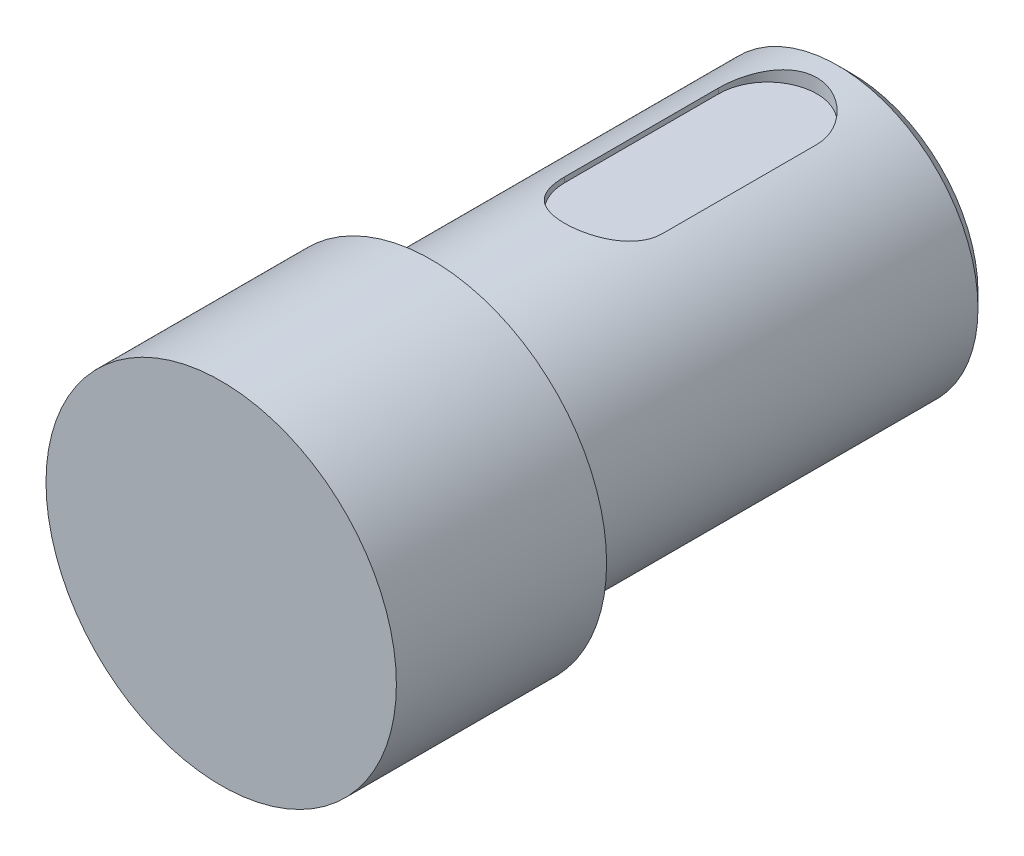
ISO-10303-21;
HEADER;
FILE_DESCRIPTION(('STEP AP214'),'2;1');
FILE_NAME('part.step','',(''),(''),'','','');
FILE_SCHEMA(('AUTOMOTIVE_DESIGN { 1 0 10303 214 1 1 1 1 }'));
ENDSEC;
DATA;
#1=APPLICATION_CONTEXT('core data for automotive mechanical design processes');
#2=APPLICATION_PROTOCOL_DEFINITION('international standard','automotive_design',2000,#1);
#3=PRODUCT_CONTEXT('',#1,'mechanical');
#4=PRODUCT('Part','Part','',(#3));
#5=PRODUCT_RELATED_PRODUCT_CATEGORY('part','',(#4));
#6=PRODUCT_DEFINITION_FORMATION('','',#4);
#7=PRODUCT_DEFINITION_CONTEXT('part definition',#1,'design');
#8=PRODUCT_DEFINITION('design','',#6,#7);
#9=PRODUCT_DEFINITION_SHAPE('','',#8);
#10=(LENGTH_UNIT() NAMED_UNIT(*) SI_UNIT(.MILLI.,.METRE.));
#11=(NAMED_UNIT(*) PLANE_ANGLE_UNIT() SI_UNIT($,.RADIAN.));
#12=(NAMED_UNIT(*) SI_UNIT($,.STERADIAN.) SOLID_ANGLE_UNIT());
#13=UNCERTAINTY_MEASURE_WITH_UNIT(LENGTH_MEASURE(1.E-05),#10,'distance_accuracy_value','');
#14=(GEOMETRIC_REPRESENTATION_CONTEXT(3) GLOBAL_UNCERTAINTY_ASSIGNED_CONTEXT((#13)) GLOBAL_UNIT_ASSIGNED_CONTEXT((#10,
#11,#12)) REPRESENTATION_CONTEXT('',''));
#15=CARTESIAN_POINT('',(0.,0.,0.));
#16=DIRECTION('',(0.,0.,1.));
#17=DIRECTION('',(1.,0.,0.));
#18=AXIS2_PLACEMENT_3D('',#15,#16,#17);
#19=CARTESIAN_POINT('',(0.,0.,60.));
#20=DIRECTION('',(0.,0.,-1.));
#21=DIRECTION('',(-1.,0.,0.));
#22=AXIS2_PLACEMENT_3D('',#19,#20,#21);
#23=CYLINDRICAL_SURFACE('',#22,20.);
#24=CARTESIAN_POINT('',(0.,0.,2.00000000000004));
#25=DIRECTION('',(0.,0.,1.));
#26=DIRECTION('',(1.,0.,0.));
#27=AXIS2_PLACEMENT_3D('',#24,#25,#26);
#28=CIRCLE('',#27,20.);
#29=CARTESIAN_POINT('',(20.,0.,2.00000000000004));
#30=VERTEX_POINT('',#29);
#31=EDGE_CURVE('E38',#30,#30,#28,.T.);
#32=ORIENTED_EDGE('',*,*,#31,.T.);
#33=EDGE_LOOP('',(#32));
#34=FACE_BOUND('',#33,.T.);
#35=DIRECTION('',(0.,0.,-1.));
#36=VECTOR('',#35,1.);
#37=CARTESIAN_POINT('',(-7.,18.7349939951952,60.));
#38=LINE('',#37,#36);
#39=CARTESIAN_POINT('',(-7.,18.7349939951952,34.));
#40=VERTEX_POINT('',#39);
#41=CARTESIAN_POINT('',(-7.,18.7349939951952,12.));
#42=VERTEX_POINT('',#41);
#43=EDGE_CURVE('E53',#40,#42,#38,.T.);
#44=ORIENTED_EDGE('',*,*,#43,.T.);
#45=CARTESIAN_POINT('',(-7.,18.7349939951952,12.));
#46=CARTESIAN_POINT('',(-7.0000277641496,18.7349606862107,11.8096396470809));
#47=CARTESIAN_POINT('',(-6.99223620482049,18.7378941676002,11.6192921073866));
#48=CARTESIAN_POINT('',(-6.9612215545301,18.7494505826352,11.2400867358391));
#49=CARTESIAN_POINT('',(-6.93800301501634,18.7580718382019,11.0512284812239));
#50=CARTESIAN_POINT('',(-6.87643935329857,18.7807238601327,10.6769479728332));
#51=CARTESIAN_POINT('',(-6.83814257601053,18.7947373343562,10.491516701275));
#52=CARTESIAN_POINT('',(-6.74679423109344,18.8277226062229,10.1247735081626));
#53=CARTESIAN_POINT('',(-6.69374204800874,18.8466946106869,9.94346175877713));
#54=CARTESIAN_POINT('',(-6.57341096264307,18.8890000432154,9.58634238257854));
#55=CARTESIAN_POINT('',(-6.50614525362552,18.9123294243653,9.41052982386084));
#56=CARTESIAN_POINT('',(-6.35788276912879,18.9626858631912,9.06527041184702));
#57=CARTESIAN_POINT('',(-6.27688087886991,18.9897142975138,8.89582595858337));
#58=CARTESIAN_POINT('',(-6.10174509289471,19.0467106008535,8.56432549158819));
#59=CARTESIAN_POINT('',(-6.00760750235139,19.0766792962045,8.40227157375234));
#60=CARTESIAN_POINT('',(-5.80682609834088,19.1387516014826,8.08645964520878));
#61=CARTESIAN_POINT('',(-5.70017777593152,19.1708559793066,7.93270465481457));
#62=CARTESIAN_POINT('',(-5.47069391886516,19.237628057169,7.62859413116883));
#63=CARTESIAN_POINT('',(-5.34739048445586,19.272346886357,7.47860271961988));
#64=CARTESIAN_POINT('',(-5.08881434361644,19.342231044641,7.18942917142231));
#65=CARTESIAN_POINT('',(-4.95354137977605,19.3773963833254,7.05024726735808));
#66=CARTESIAN_POINT('',(-4.6717904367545,19.4472476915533,6.78348559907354));
#67=CARTESIAN_POINT('',(-4.52530848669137,19.4819334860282,6.65590998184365));
#68=CARTESIAN_POINT('',(-4.22210126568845,19.5498845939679,6.41327016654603));
#69=CARTESIAN_POINT('',(-4.0653795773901,19.58315039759,6.2982016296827));
#70=CARTESIAN_POINT('',(-3.73779763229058,19.6483477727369,6.07809593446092));
#71=CARTESIAN_POINT('',(-3.56665627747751,19.6802107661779,5.97345621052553));
#72=CARTESIAN_POINT('',(-3.21563233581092,19.7406030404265,5.77907216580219));
#73=CARTESIAN_POINT('',(-3.03575303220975,19.7691335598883,5.68932230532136));
#74=CARTESIAN_POINT('',(-2.66843515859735,19.8220553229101,5.52544257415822));
#75=CARTESIAN_POINT('',(-2.48099708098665,19.8464468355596,5.45131168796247));
#76=CARTESIAN_POINT('',(-2.09991493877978,19.8903779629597,5.31935555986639));
#77=CARTESIAN_POINT('',(-1.90627117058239,19.9099178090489,5.26152954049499));
#78=CARTESIAN_POINT('',(-1.52172056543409,19.9429230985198,5.16463785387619));
#79=CARTESIAN_POINT('',(-1.33098972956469,19.9565913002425,5.12494233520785));
#80=CARTESIAN_POINT('',(-0.946581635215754,19.9785144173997,5.06156177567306));
#81=CARTESIAN_POINT('',(-0.752904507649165,19.986769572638,5.03787602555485));
#82=CARTESIAN_POINT('',(-0.364132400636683,19.9976302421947,5.00675839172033));
#83=CARTESIAN_POINT('',(-0.169037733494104,20.0002369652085,4.99932303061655));
#84=CARTESIAN_POINT('',(0.221080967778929,19.9997291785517,5.00077370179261));
#85=CARTESIAN_POINT('',(0.416105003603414,19.9966148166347,5.00965931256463));
#86=CARTESIAN_POINT('',(0.796114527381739,19.9850133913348,5.04291816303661));
#87=CARTESIAN_POINT('',(0.981168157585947,19.9767655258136,5.06660205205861));
#88=CARTESIAN_POINT('',(1.34857867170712,19.9553303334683,5.12860603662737));
#89=CARTESIAN_POINT('',(1.53093464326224,19.942141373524,5.16693097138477));
#90=CARTESIAN_POINT('',(1.8915822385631,19.9111693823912,5.25785712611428));
#91=CARTESIAN_POINT('',(2.06987520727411,19.8933878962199,5.31045354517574));
#92=CARTESIAN_POINT('',(2.42136719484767,19.8536716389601,5.42950340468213));
#93=CARTESIAN_POINT('',(2.59456425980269,19.8317352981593,5.49596208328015));
#94=CARTESIAN_POINT('',(2.93700500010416,19.7839402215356,5.64317683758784));
#95=CARTESIAN_POINT('',(3.10616461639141,19.7580328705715,5.72411254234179));
#96=CARTESIAN_POINT('',(3.43712057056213,19.7031558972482,5.89907773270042));
#97=CARTESIAN_POINT('',(3.59891436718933,19.6741852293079,5.9931116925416));
#98=CARTESIAN_POINT('',(3.91416243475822,19.6139004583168,6.19360438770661));
#99=CARTESIAN_POINT('',(4.06761614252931,19.5825861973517,6.30006396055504));
#100=CARTESIAN_POINT('',(4.36532836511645,19.5183785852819,6.52472029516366));
#101=CARTESIAN_POINT('',(4.50958650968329,19.4854851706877,6.64291752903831));
#102=CARTESIAN_POINT('',(4.79532406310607,19.417197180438,6.89674157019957));
#103=CARTESIAN_POINT('',(4.93627427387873,19.3817612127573,7.03295354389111));
#104=CARTESIAN_POINT('',(5.20623081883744,19.3109976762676,7.31667908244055));
#105=CARTESIAN_POINT('',(5.33524082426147,19.2756700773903,7.46418914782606));
#106=CARTESIAN_POINT('',(5.58064360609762,19.2060589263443,7.76977029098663));
#107=CARTESIAN_POINT('',(5.6970272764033,19.1717761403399,7.92784885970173));
#108=CARTESIAN_POINT('',(5.91624306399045,19.1052659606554,8.25345866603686));
#109=CARTESIAN_POINT('',(6.01908046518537,19.0730377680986,8.4209861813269));
#110=CARTESIAN_POINT('',(6.2122416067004,19.0110109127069,8.76764296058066));
#111=CARTESIAN_POINT('',(6.30230460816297,18.9812669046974,8.94692752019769));
#112=CARTESIAN_POINT('',(6.46686916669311,18.9258327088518,9.31302011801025));
#113=CARTESIAN_POINT('',(6.54137725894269,18.9001408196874,9.49982495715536));
#114=CARTESIAN_POINT('',(6.67411765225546,18.8536761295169,9.87949389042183));
#115=CARTESIAN_POINT('',(6.73236809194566,18.8328978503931,10.0723509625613));
#116=CARTESIAN_POINT('',(6.83209645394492,18.7969480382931,10.4627822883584));
#117=CARTESIAN_POINT('',(6.87358199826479,18.7817739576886,10.6603543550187));
#118=CARTESIAN_POINT('',(6.93755698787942,18.7582371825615,11.047798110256));
#119=CARTESIAN_POINT('',(6.96096228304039,18.749546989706,11.2374989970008));
#120=CARTESIAN_POINT('',(6.99218828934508,18.737912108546,11.6181282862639));
#121=CARTESIAN_POINT('',(7.0000271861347,18.734960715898,11.8090549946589));
#122=CARTESIAN_POINT('',(7.,18.7349939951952,12.));
#123=B_SPLINE_CURVE_WITH_KNOTS('',3,(#45,#46,#47,#48,#49,#50,#51,#52,#53,#54,#55,#56,#57,#58,
#59,#60,#61,#62,#63,#64,#65,#66,#67,#68,#69,#70,#71,#72,#73,#74,#75,#76,#77,#78,#79,#80,#81,#82,
#83,#84,#85,#86,#87,#88,#89,#90,#91,#92,#93,#94,#95,#96,#97,#98,#99,#100,#101,#102,#103,#104,
#105,#106,#107,#108,#109,#110,#111,#112,#113,#114,#115,#116,#117,#118,#119,#120,#121,#122),
.UNSPECIFIED.,.F.,.F.,(4,2,2,2,2,2,2,2,2,2,2,2,2,2,2,2,2,2,2,2,2,2,2,2,2,2,2,2,2,2,2,2,2,2,2,2,
2,2,4),(0.,0.570879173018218,1.14158999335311,1.71048566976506,2.27940507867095,2.84779870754,
3.41640444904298,3.98517045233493,4.55414207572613,5.1452177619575,5.73630616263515,
6.32760493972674,6.91869793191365,7.52727629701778,8.13562773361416,8.7439396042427,
9.35222246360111,9.9373711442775,10.5224939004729,11.1074914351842,11.6924738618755,
12.2520518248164,12.811814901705,13.3713899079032,13.9311767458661,14.4984637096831,
15.0659449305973,15.6334644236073,16.2010067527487,16.7978894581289,17.3945880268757,
17.99171411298,18.5886065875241,19.1963230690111,19.8037837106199,20.4105638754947,
21.0170678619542,21.5903586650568,22.1629793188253),.UNSPECIFIED.);
#124=CARTESIAN_POINT('',(7.,18.7349939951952,12.));
#125=VERTEX_POINT('',#124);
#126=EDGE_CURVE('E110',#42,#125,#123,.T.);
#127=ORIENTED_EDGE('',*,*,#126,.T.);
#128=DIRECTION('',(0.,0.,-1.));
#129=VECTOR('',#128,1.);
#130=CARTESIAN_POINT('',(7.,18.7349939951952,60.));
#131=LINE('',#130,#129);
#132=CARTESIAN_POINT('',(7.,18.7349939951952,34.));
#133=VERTEX_POINT('',#132);
#134=EDGE_CURVE('E160',#125,#133,#131,.F.);
#135=ORIENTED_EDGE('',*,*,#134,.T.);
#136=CARTESIAN_POINT('',(7.,18.7349939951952,34.));
#137=CARTESIAN_POINT('',(7.0000277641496,18.7349606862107,34.1903603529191));
#138=CARTESIAN_POINT('',(6.99223620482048,18.7378941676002,34.3807078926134));
#139=CARTESIAN_POINT('',(6.9612215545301,18.7494505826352,34.7599132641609));
#140=CARTESIAN_POINT('',(6.93800301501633,18.7580718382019,34.9487715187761));
#141=CARTESIAN_POINT('',(6.87643935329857,18.7807238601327,35.3230520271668));
#142=CARTESIAN_POINT('',(6.83814257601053,18.7947373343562,35.508483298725));
#143=CARTESIAN_POINT('',(6.74679423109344,18.8277226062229,35.8752264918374));
#144=CARTESIAN_POINT('',(6.69374204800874,18.8466946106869,36.0565382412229));
#145=CARTESIAN_POINT('',(6.57341096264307,18.8890000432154,36.4136576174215));
#146=CARTESIAN_POINT('',(6.50614525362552,18.9123294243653,36.5894701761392));
#147=CARTESIAN_POINT('',(6.35788276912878,18.9626858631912,36.934729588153));
#148=CARTESIAN_POINT('',(6.27688087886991,18.9897142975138,37.1041740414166));
#149=CARTESIAN_POINT('',(6.1017450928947,19.0467106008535,37.4356745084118));
#150=CARTESIAN_POINT('',(6.00760750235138,19.0766792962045,37.5977284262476));
#151=CARTESIAN_POINT('',(5.80682609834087,19.1387516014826,37.9135403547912));
#152=CARTESIAN_POINT('',(5.70017777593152,19.1708559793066,38.0672953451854));
#153=CARTESIAN_POINT('',(5.47069391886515,19.237628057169,38.3714058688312));
#154=CARTESIAN_POINT('',(5.34739048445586,19.272346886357,38.5213972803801));
#155=CARTESIAN_POINT('',(5.08881434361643,19.342231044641,38.8105708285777));
#156=CARTESIAN_POINT('',(4.95354137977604,19.3773963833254,38.9497527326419));
#157=CARTESIAN_POINT('',(4.67179043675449,19.4472476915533,39.2165144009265));
#158=CARTESIAN_POINT('',(4.52530848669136,19.4819334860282,39.3440900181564));
#159=CARTESIAN_POINT('',(4.22210126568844,19.5498845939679,39.586729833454));
#160=CARTESIAN_POINT('',(4.06537957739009,19.58315039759,39.7017983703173));
#161=CARTESIAN_POINT('',(3.73779763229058,19.6483477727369,39.9219040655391));
#162=CARTESIAN_POINT('',(3.5666562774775,19.6802107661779,40.0265437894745));
#163=CARTESIAN_POINT('',(3.21563233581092,19.7406030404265,40.2209278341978));
#164=CARTESIAN_POINT('',(3.03575303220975,19.7691335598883,40.3106776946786));
#165=CARTESIAN_POINT('',(2.66843515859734,19.8220553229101,40.4745574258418));
#166=CARTESIAN_POINT('',(2.48099708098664,19.8464468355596,40.5486883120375));
#167=CARTESIAN_POINT('',(2.09991493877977,19.8903779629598,40.6806444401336));
#168=CARTESIAN_POINT('',(1.90627117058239,19.9099178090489,40.738470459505));
#169=CARTESIAN_POINT('',(1.52172056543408,19.9429230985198,40.8353621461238));
#170=CARTESIAN_POINT('',(1.33098972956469,19.9565913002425,40.8750576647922));
#171=CARTESIAN_POINT('',(0.946581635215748,19.9785144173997,40.9384382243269));
#172=CARTESIAN_POINT('',(0.752904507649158,19.986769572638,40.9621239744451));
#173=CARTESIAN_POINT('',(0.364132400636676,19.9976302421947,40.9932416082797));
#174=CARTESIAN_POINT('',(0.169037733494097,20.0002369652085,41.0006769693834));
#175=CARTESIAN_POINT('',(-0.221080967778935,19.9997291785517,40.9992262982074));
#176=CARTESIAN_POINT('',(-0.416105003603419,19.9966148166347,40.9903406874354));
#177=CARTESIAN_POINT('',(-0.796114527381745,19.9850133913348,40.9570818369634));
#178=CARTESIAN_POINT('',(-0.981168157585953,19.9767655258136,40.9333979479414));
#179=CARTESIAN_POINT('',(-1.34857867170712,19.9553303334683,40.8713939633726));
#180=CARTESIAN_POINT('',(-1.53093464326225,19.942141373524,40.8330690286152));
#181=CARTESIAN_POINT('',(-1.89158223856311,19.9111693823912,40.7421428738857));
#182=CARTESIAN_POINT('',(-2.06987520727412,19.8933878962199,40.6895464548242));
#183=CARTESIAN_POINT('',(-2.42136719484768,19.8536716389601,40.5704965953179));
#184=CARTESIAN_POINT('',(-2.59456425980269,19.8317352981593,40.5040379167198));
#185=CARTESIAN_POINT('',(-2.93700500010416,19.7839402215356,40.3568231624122));
#186=CARTESIAN_POINT('',(-3.10616461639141,19.7580328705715,40.2758874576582));
#187=CARTESIAN_POINT('',(-3.43712057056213,19.7031558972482,40.1009222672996));
#188=CARTESIAN_POINT('',(-3.59891436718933,19.6741852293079,40.0068883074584));
#189=CARTESIAN_POINT('',(-3.91416243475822,19.6139004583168,39.8063956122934));
#190=CARTESIAN_POINT('',(-4.06761614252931,19.5825861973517,39.699936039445));
#191=CARTESIAN_POINT('',(-4.36532836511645,19.5183785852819,39.4752797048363));
#192=CARTESIAN_POINT('',(-4.50958650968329,19.4854851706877,39.3570824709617));
#193=CARTESIAN_POINT('',(-4.79532406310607,19.417197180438,39.1032584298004));
#194=CARTESIAN_POINT('',(-4.93627427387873,19.3817612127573,38.9670464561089));
#195=CARTESIAN_POINT('',(-5.20623081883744,19.3109976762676,38.6833209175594));
#196=CARTESIAN_POINT('',(-5.33524082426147,19.2756700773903,38.5358108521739));
#197=CARTESIAN_POINT('',(-5.58064360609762,19.2060589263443,38.2302297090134));
#198=CARTESIAN_POINT('',(-5.6970272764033,19.1717761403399,38.0721511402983));
#199=CARTESIAN_POINT('',(-5.91624306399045,19.1052659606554,37.7465413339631));
#200=CARTESIAN_POINT('',(-6.01908046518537,19.0730377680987,37.5790138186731));
#201=CARTESIAN_POINT('',(-6.2122416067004,19.0110109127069,37.2323570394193));
#202=CARTESIAN_POINT('',(-6.30230460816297,18.9812669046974,37.0530724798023));
#203=CARTESIAN_POINT('',(-6.46686916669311,18.9258327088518,36.6869798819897));
#204=CARTESIAN_POINT('',(-6.54137725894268,18.9001408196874,36.5001750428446));
#205=CARTESIAN_POINT('',(-6.67411765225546,18.8536761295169,36.1205061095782));
#206=CARTESIAN_POINT('',(-6.73236809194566,18.8328978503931,35.9276490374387));
#207=CARTESIAN_POINT('',(-6.83209645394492,18.7969480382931,35.5372177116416));
#208=CARTESIAN_POINT('',(-6.87358199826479,18.7817739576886,35.3396456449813));
#209=CARTESIAN_POINT('',(-6.93755698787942,18.7582371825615,34.952201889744));
#210=CARTESIAN_POINT('',(-6.96096228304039,18.749546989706,34.7625010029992));
#211=CARTESIAN_POINT('',(-6.99218828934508,18.737912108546,34.3818717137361));
#212=CARTESIAN_POINT('',(-7.00002718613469,18.734960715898,34.1909450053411));
#213=CARTESIAN_POINT('',(-7.,18.7349939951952,34.));
#214=B_SPLINE_CURVE_WITH_KNOTS('',3,(#136,#137,#138,#139,#140,#141,#142,#143,#144,#145,#146,
#147,#148,#149,#150,#151,#152,#153,#154,#155,#156,#157,#158,#159,#160,#161,#162,#163,#164,#165,
#166,#167,#168,#169,#170,#171,#172,#173,#174,#175,#176,#177,#178,#179,#180,#181,#182,#183,#184,
#185,#186,#187,#188,#189,#190,#191,#192,#193,#194,#195,#196,#197,#198,#199,#200,#201,#202,#203,
#204,#205,#206,#207,#208,#209,#210,#211,#212,#213),.UNSPECIFIED.,.F.,.F.,(4,2,2,2,2,2,2,2,2,2,2,
2,2,2,2,2,2,2,2,2,2,2,2,2,2,2,2,2,2,2,2,2,2,2,2,2,2,2,4),(0.,0.570879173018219,1.14158999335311,
1.71048566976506,2.27940507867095,2.84779870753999,3.41640444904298,3.98517045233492,
4.55414207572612,5.1452177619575,5.73630616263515,6.32760493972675,6.91869793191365,
7.52727629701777,8.13562773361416,8.74393960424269,9.35222246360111,9.9373711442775,
10.5224939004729,11.1074914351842,11.6924738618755,12.2520518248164,12.811814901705,
13.3713899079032,13.9311767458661,14.4984637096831,15.0659449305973,15.6334644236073,
16.2010067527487,16.7978894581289,17.3945880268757,17.99171411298,18.5886065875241,
19.1963230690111,19.8037837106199,20.4105638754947,21.0170678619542,21.5903586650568,
22.1629793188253),.UNSPECIFIED.);
#215=EDGE_CURVE('E45',#133,#40,#214,.T.);
#216=ORIENTED_EDGE('',*,*,#215,.T.);
#217=EDGE_LOOP('',(#44,#127,#135,#216));
#218=FACE_BOUND('',#217,.T.);
#219=CARTESIAN_POINT('',(0.,0.,60.));
#220=DIRECTION('',(0.,0.,1.));
#221=DIRECTION('',(1.,0.,0.));
#222=AXIS2_PLACEMENT_3D('',#219,#220,#221);
#223=CIRCLE('',#222,20.);
#224=CARTESIAN_POINT('',(20.,0.,60.));
#225=VERTEX_POINT('',#224);
#226=EDGE_CURVE('E105',#225,#225,#223,.T.);
#227=ORIENTED_EDGE('',*,*,#226,.F.);
#228=EDGE_LOOP('',(#227));
#229=FACE_BOUND('',#228,.T.);
#230=ADVANCED_FACE('F30',(#34,#218,#229),#23,.T.);
#231=CARTESIAN_POINT('',(0.,0.,0.));
#232=DIRECTION('',(0.,0.,1.));
#233=DIRECTION('',(1.,0.,0.));
#234=AXIS2_PLACEMENT_3D('',#231,#232,#233);
#235=PLANE('',#234);
#236=CARTESIAN_POINT('',(0.,0.,0.));
#237=DIRECTION('',(0.,0.,1.));
#238=DIRECTION('',(1.,0.,0.));
#239=AXIS2_PLACEMENT_3D('',#236,#237,#238);
#240=CIRCLE('',#239,17.9999999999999);
#241=CARTESIAN_POINT('',(17.9999999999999,0.,0.));
#242=VERTEX_POINT('',#241);
#243=EDGE_CURVE('E11',#242,#242,#240,.F.);
#244=ORIENTED_EDGE('',*,*,#243,.T.);
#245=EDGE_LOOP('',(#244));
#246=FACE_BOUND('',#245,.T.);
#247=ADVANCED_FACE('F144',(#246),#235,.F.);
#248=CARTESIAN_POINT('',(0.,0.,60.));
#249=DIRECTION('',(0.,0.,1.));
#250=DIRECTION('',(1.,0.,0.));
#251=AXIS2_PLACEMENT_3D('',#248,#249,#250);
#252=PLANE('',#251);
#253=CARTESIAN_POINT('',(0.,0.,60.));
#254=DIRECTION('',(0.,0.,1.));
#255=DIRECTION('',(1.,0.,0.));
#256=AXIS2_PLACEMENT_3D('',#253,#254,#255);
#257=CIRCLE('',#256,25.);
#258=CARTESIAN_POINT('',(25.,0.,60.));
#259=VERTEX_POINT('',#258);
#260=EDGE_CURVE('E98',#259,#259,#257,.T.);
#261=ORIENTED_EDGE('',*,*,#260,.F.);
#262=EDGE_LOOP('',(#261));
#263=FACE_BOUND('',#262,.T.);
#264=ORIENTED_EDGE('',*,*,#226,.T.);
#265=EDGE_LOOP('',(#264));
#266=FACE_BOUND('',#265,.T.);
#267=ADVANCED_FACE('F141',(#263,#266),#252,.F.);
#268=CARTESIAN_POINT('',(0.,0.,90.));
#269=DIRECTION('',(0.,0.,-1.));
#270=DIRECTION('',(-1.,0.,0.));
#271=AXIS2_PLACEMENT_3D('',#268,#269,#270);
#272=CYLINDRICAL_SURFACE('',#271,25.);
#273=CARTESIAN_POINT('',(0.,0.,90.));
#274=DIRECTION('',(0.,0.,1.));
#275=DIRECTION('',(1.,0.,0.));
#276=AXIS2_PLACEMENT_3D('',#273,#274,#275);
#277=CIRCLE('',#276,25.);
#278=CARTESIAN_POINT('',(25.,0.,90.));
#279=VERTEX_POINT('',#278);
#280=EDGE_CURVE('E102',#279,#279,#277,.T.);
#281=ORIENTED_EDGE('',*,*,#280,.F.);
#282=EDGE_LOOP('',(#281));
#283=FACE_BOUND('',#282,.T.);
#284=ORIENTED_EDGE('',*,*,#260,.T.);
#285=EDGE_LOOP('',(#284));
#286=FACE_BOUND('',#285,.T.);
#287=ADVANCED_FACE('F139',(#283,#286),#272,.T.);
#288=CARTESIAN_POINT('',(0.,0.,90.));
#289=DIRECTION('',(0.,0.,1.));
#290=DIRECTION('',(1.,0.,0.));
#291=AXIS2_PLACEMENT_3D('',#288,#289,#290);
#292=PLANE('',#291);
#293=ORIENTED_EDGE('',*,*,#280,.T.);
#294=EDGE_LOOP('',(#293));
#295=FACE_BOUND('',#294,.T.);
#296=ADVANCED_FACE('F136',(#295),#292,.T.);
#297=CARTESIAN_POINT('',(0.,18.,34.));
#298=DIRECTION('',(0.,1.,0.));
#299=DIRECTION('',(0.,0.,1.));
#300=AXIS2_PLACEMENT_3D('',#297,#298,#299);
#301=CYLINDRICAL_SURFACE('',#300,7.);
#302=DIRECTION('',(0.,1.,0.));
#303=VECTOR('',#302,1.);
#304=CARTESIAN_POINT('',(7.,18.,34.));
#305=LINE('',#304,#303);
#306=CARTESIAN_POINT('',(7.,18.,34.));
#307=VERTEX_POINT('',#306);
#308=EDGE_CURVE('E70',#307,#133,#305,.T.);
#309=ORIENTED_EDGE('',*,*,#308,.F.);
#310=CARTESIAN_POINT('',(0.,18.,34.));
#311=DIRECTION('',(0.,1.,0.));
#312=DIRECTION('',(0.,0.,-1.));
#313=AXIS2_PLACEMENT_3D('',#310,#311,#312);
#314=CIRCLE('',#313,7.);
#315=CARTESIAN_POINT('',(-7.,18.,34.));
#316=VERTEX_POINT('',#315);
#317=EDGE_CURVE('E74',#316,#307,#314,.T.);
#318=ORIENTED_EDGE('',*,*,#317,.F.);
#319=DIRECTION('',(0.,1.,0.));
#320=VECTOR('',#319,1.);
#321=CARTESIAN_POINT('',(-7.,18.,34.));
#322=LINE('',#321,#320);
#323=EDGE_CURVE('E96',#316,#40,#322,.T.);
#324=ORIENTED_EDGE('',*,*,#323,.T.);
#325=ORIENTED_EDGE('',*,*,#215,.F.);
#326=EDGE_LOOP('',(#309,#318,#324,#325));
#327=FACE_BOUND('',#326,.T.);
#328=ADVANCED_FACE('F72',(#327),#301,.F.);
#329=CARTESIAN_POINT('',(-7.,18.,34.));
#330=DIRECTION('',(-1.,0.,0.));
#331=DIRECTION('',(0.,0.,1.));
#332=AXIS2_PLACEMENT_3D('',#329,#330,#331);
#333=PLANE('',#332);
#334=ORIENTED_EDGE('',*,*,#323,.F.);
#335=DIRECTION('',(0.,0.,1.));
#336=VECTOR('',#335,1.);
#337=CARTESIAN_POINT('',(-7.,18.,34.));
#338=LINE('',#337,#336);
#339=CARTESIAN_POINT('',(-7.,18.,12.));
#340=VERTEX_POINT('',#339);
#341=EDGE_CURVE('E79',#340,#316,#338,.T.);
#342=ORIENTED_EDGE('',*,*,#341,.F.);
#343=DIRECTION('',(0.,1.,0.));
#344=VECTOR('',#343,1.);
#345=CARTESIAN_POINT('',(-7.,18.,12.));
#346=LINE('',#345,#344);
#347=EDGE_CURVE('E99',#340,#42,#346,.T.);
#348=ORIENTED_EDGE('',*,*,#347,.T.);
#349=ORIENTED_EDGE('',*,*,#43,.F.);
#350=EDGE_LOOP('',(#334,#342,#348,#349));
#351=FACE_BOUND('',#350,.T.);
#352=ADVANCED_FACE('F129',(#351),#333,.F.);
#353=CARTESIAN_POINT('',(0.,18.,12.));
#354=DIRECTION('',(0.,1.,0.));
#355=DIRECTION('',(0.,0.,1.));
#356=AXIS2_PLACEMENT_3D('',#353,#354,#355);
#357=CYLINDRICAL_SURFACE('',#356,7.);
#358=ORIENTED_EDGE('',*,*,#347,.F.);
#359=CARTESIAN_POINT('',(0.,18.,12.));
#360=DIRECTION('',(0.,1.,0.));
#361=DIRECTION('',(0.,0.,1.));
#362=AXIS2_PLACEMENT_3D('',#359,#360,#361);
#363=CIRCLE('',#362,7.);
#364=CARTESIAN_POINT('',(7.,18.,12.));
#365=VERTEX_POINT('',#364);
#366=EDGE_CURVE('E88',#365,#340,#363,.T.);
#367=ORIENTED_EDGE('',*,*,#366,.F.);
#368=DIRECTION('',(0.,1.,0.));
#369=VECTOR('',#368,1.);
#370=CARTESIAN_POINT('',(7.,18.,12.));
#371=LINE('',#370,#369);
#372=EDGE_CURVE('E78',#365,#125,#371,.T.);
#373=ORIENTED_EDGE('',*,*,#372,.T.);
#374=ORIENTED_EDGE('',*,*,#126,.F.);
#375=EDGE_LOOP('',(#358,#367,#373,#374));
#376=FACE_BOUND('',#375,.T.);
#377=ADVANCED_FACE('F124',(#376),#357,.F.);
#378=CARTESIAN_POINT('',(7.,18.,34.));
#379=DIRECTION('',(1.,0.,0.));
#380=DIRECTION('',(0.,0.,-1.));
#381=AXIS2_PLACEMENT_3D('',#378,#379,#380);
#382=PLANE('',#381);
#383=ORIENTED_EDGE('',*,*,#372,.F.);
#384=DIRECTION('',(0.,0.,-1.));
#385=VECTOR('',#384,1.);
#386=CARTESIAN_POINT('',(7.,18.,34.));
#387=LINE('',#386,#385);
#388=EDGE_CURVE('E82',#307,#365,#387,.T.);
#389=ORIENTED_EDGE('',*,*,#388,.F.);
#390=ORIENTED_EDGE('',*,*,#308,.T.);
#391=ORIENTED_EDGE('',*,*,#134,.F.);
#392=EDGE_LOOP('',(#383,#389,#390,#391));
#393=FACE_BOUND('',#392,.T.);
#394=ADVANCED_FACE('F83',(#393),#382,.F.);
#395=CARTESIAN_POINT('',(0.,18.,34.));
#396=DIRECTION('',(0.,-1.,0.));
#397=DIRECTION('',(0.,0.,-1.));
#398=AXIS2_PLACEMENT_3D('',#395,#396,#397);
#399=PLANE('',#398);
#400=ORIENTED_EDGE('',*,*,#317,.T.);
#401=ORIENTED_EDGE('',*,*,#388,.T.);
#402=ORIENTED_EDGE('',*,*,#366,.T.);
#403=ORIENTED_EDGE('',*,*,#341,.T.);
#404=EDGE_LOOP('',(#400,#401,#402,#403));
#405=FACE_BOUND('',#404,.T.);
#406=ADVANCED_FACE('F90',(#405),#399,.F.);
#407=CARTESIAN_POINT('',(0.,0.,2.00000000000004));
#408=DIRECTION('',(0.,0.,1.));
#409=DIRECTION('',(1.,0.,0.));
#410=AXIS2_PLACEMENT_3D('',#407,#408,#409);
#411=CONICAL_SURFACE('',#410,20.,0.785398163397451);
#412=ORIENTED_EDGE('',*,*,#243,.F.);
#413=EDGE_LOOP('',(#412));
#414=FACE_BOUND('',#413,.T.);
#415=ORIENTED_EDGE('',*,*,#31,.F.);
#416=EDGE_LOOP('',(#415));
#417=FACE_BOUND('',#416,.T.);
#418=ADVANCED_FACE('F32',(#414,#417),#411,.T.);
#419=CLOSED_SHELL('',(#230,#247,#267,#287,#296,#328,#352,#377,#394,#406,#418));
#420=MANIFOLD_SOLID_BREP('B2',#419);
#421=ADVANCED_BREP_SHAPE_REPRESENTATION('',(#18,#420),#14);
#422=SHAPE_DEFINITION_REPRESENTATION(#9,#421);
ENDSEC;
END-ISO-10303-21;
